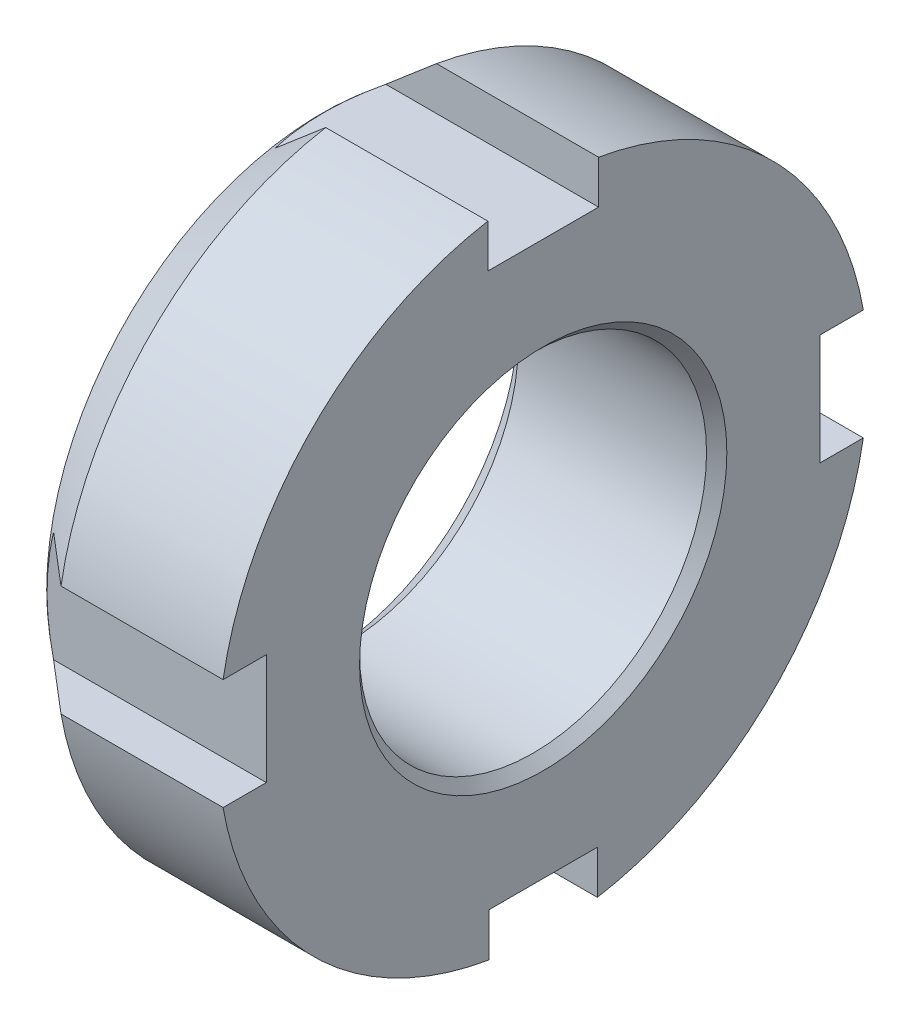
ISO-10303-21;
HEADER;
FILE_DESCRIPTION(('STEP AP214'),'2;1');
FILE_NAME('part.step','',(''),(''),'','','');
FILE_SCHEMA(('AUTOMOTIVE_DESIGN { 1 0 10303 214 1 1 1 1 }'));
ENDSEC;
DATA;
#1=APPLICATION_CONTEXT('core data for automotive mechanical design processes');
#2=APPLICATION_PROTOCOL_DEFINITION('international standard','automotive_design',2000,#1);
#3=PRODUCT_CONTEXT('',#1,'mechanical');
#4=PRODUCT('Part','Part','',(#3));
#5=PRODUCT_RELATED_PRODUCT_CATEGORY('part','',(#4));
#6=PRODUCT_DEFINITION_FORMATION('','',#4);
#7=PRODUCT_DEFINITION_CONTEXT('part definition',#1,'design');
#8=PRODUCT_DEFINITION('design','',#6,#7);
#9=PRODUCT_DEFINITION_SHAPE('','',#8);
#10=(LENGTH_UNIT() NAMED_UNIT(*) SI_UNIT(.MILLI.,.METRE.));
#11=(NAMED_UNIT(*) PLANE_ANGLE_UNIT() SI_UNIT($,.RADIAN.));
#12=(NAMED_UNIT(*) SI_UNIT($,.STERADIAN.) SOLID_ANGLE_UNIT());
#13=UNCERTAINTY_MEASURE_WITH_UNIT(LENGTH_MEASURE(1.E-05),#10,'distance_accuracy_value','');
#14=(GEOMETRIC_REPRESENTATION_CONTEXT(3) GLOBAL_UNCERTAINTY_ASSIGNED_CONTEXT((#13)) GLOBAL_UNIT_ASSIGNED_CONTEXT((#10,
#11,#12)) REPRESENTATION_CONTEXT('',''));
#15=CARTESIAN_POINT('',(0.,0.,0.));
#16=DIRECTION('',(0.,0.,1.));
#17=DIRECTION('',(1.,0.,0.));
#18=AXIS2_PLACEMENT_3D('',#15,#16,#17);
#19=CARTESIAN_POINT('',(0.,0.,0.));
#20=DIRECTION('',(-1.,0.,0.));
#21=DIRECTION('',(0.,0.,1.));
#22=AXIS2_PLACEMENT_3D('',#19,#20,#21);
#23=CYLINDRICAL_SURFACE('',#22,11.176);
#24=CARTESIAN_POINT('',(2.04326153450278,0.,0.));
#25=DIRECTION('',(-1.,0.,0.));
#26=DIRECTION('',(0.,0.,1.));
#27=AXIS2_PLACEMENT_3D('',#24,#25,#26);
#28=CIRCLE('',#27,11.176);
#29=CARTESIAN_POINT('',(2.04326153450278,-11.0196846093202,1.86266666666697));
#30=VERTEX_POINT('',#29);
#31=CARTESIAN_POINT('',(2.04326153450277,-1.905,11.0124452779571));
#32=VERTEX_POINT('',#31);
#33=EDGE_CURVE('E219',#30,#32,#28,.T.);
#34=ORIENTED_EDGE('',*,*,#33,.F.);
#35=DIRECTION('',(1.,0.,0.));
#36=VECTOR('',#35,1.);
#37=CARTESIAN_POINT('',(0.,-11.0196846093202,1.86266666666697));
#38=LINE('',#37,#36);
#39=CARTESIAN_POINT('',(7.62000000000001,-11.0196846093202,1.86266666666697));
#40=VERTEX_POINT('',#39);
#41=EDGE_CURVE('E267',#30,#40,#38,.T.);
#42=ORIENTED_EDGE('',*,*,#41,.T.);
#43=CARTESIAN_POINT('',(7.62000000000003,0.,0.));
#44=DIRECTION('',(-1.,0.,0.));
#45=DIRECTION('',(0.,0.,1.));
#46=AXIS2_PLACEMENT_3D('',#43,#44,#45);
#47=CIRCLE('',#46,11.176);
#48=CARTESIAN_POINT('',(7.62000000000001,-1.905,11.0124452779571));
#49=VERTEX_POINT('',#48);
#50=EDGE_CURVE('E183',#40,#49,#47,.T.);
#51=ORIENTED_EDGE('',*,*,#50,.T.);
#52=DIRECTION('',(1.,0.,0.));
#53=VECTOR('',#52,1.);
#54=CARTESIAN_POINT('',(0.,-1.905,11.0124452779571));
#55=LINE('',#54,#53);
#56=EDGE_CURVE('E237',#32,#49,#55,.T.);
#57=ORIENTED_EDGE('',*,*,#56,.F.);
#58=EDGE_LOOP('',(#34,#42,#51,#57));
#59=FACE_BOUND('',#58,.T.);
#60=ADVANCED_FACE('F39',(#59),#23,.T.);
#61=CARTESIAN_POINT('',(2.04326153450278,11.0124452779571,-1.905));
#62=VERTEX_POINT('',#61);
#63=CARTESIAN_POINT('',(2.04326153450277,1.905,-11.0124452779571));
#64=VERTEX_POINT('',#63);
#65=EDGE_CURVE('E229',#62,#64,#28,.T.);
#66=ORIENTED_EDGE('',*,*,#65,.F.);
#67=DIRECTION('',(1.,0.,0.));
#68=VECTOR('',#67,1.);
#69=CARTESIAN_POINT('',(0.,11.0124452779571,-1.905));
#70=LINE('',#69,#68);
#71=CARTESIAN_POINT('',(7.62000000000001,11.0124452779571,-1.905));
#72=VERTEX_POINT('',#71);
#73=EDGE_CURVE('E254',#62,#72,#70,.T.);
#74=ORIENTED_EDGE('',*,*,#73,.T.);
#75=CARTESIAN_POINT('',(7.62000000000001,1.905,-11.0124452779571));
#76=VERTEX_POINT('',#75);
#77=EDGE_CURVE('E189',#72,#76,#47,.T.);
#78=ORIENTED_EDGE('',*,*,#77,.T.);
#79=DIRECTION('',(1.,0.,0.));
#80=VECTOR('',#79,1.);
#81=CARTESIAN_POINT('',(0.,1.905,-11.0124452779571));
#82=LINE('',#81,#80);
#83=EDGE_CURVE('E222',#64,#76,#82,.T.);
#84=ORIENTED_EDGE('',*,*,#83,.F.);
#85=EDGE_LOOP('',(#66,#74,#78,#84));
#86=FACE_BOUND('',#85,.T.);
#87=ADVANCED_FACE('F301',(#86),#23,.T.);
#88=CARTESIAN_POINT('',(7.62000000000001,-1.90500000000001,-11.0124452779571));
#89=VERTEX_POINT('',#88);
#90=CARTESIAN_POINT('',(7.62000000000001,-11.0196846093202,-1.86266666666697));
#91=VERTEX_POINT('',#90);
#92=EDGE_CURVE('E174',#89,#91,#47,.T.);
#93=ORIENTED_EDGE('',*,*,#92,.T.);
#94=DIRECTION('',(1.,0.,0.));
#95=VECTOR('',#94,1.);
#96=CARTESIAN_POINT('',(0.,-11.0196846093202,-1.86266666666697));
#97=LINE('',#96,#95);
#98=CARTESIAN_POINT('',(2.04326153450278,-11.0196846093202,-1.86266666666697));
#99=VERTEX_POINT('',#98);
#100=EDGE_CURVE('E155',#99,#91,#97,.T.);
#101=ORIENTED_EDGE('',*,*,#100,.F.);
#102=CARTESIAN_POINT('',(2.04326153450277,-1.90500000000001,-11.0124452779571));
#103=VERTEX_POINT('',#102);
#104=EDGE_CURVE('E217',#103,#99,#28,.T.);
#105=ORIENTED_EDGE('',*,*,#104,.F.);
#106=DIRECTION('',(1.,0.,0.));
#107=VECTOR('',#106,1.);
#108=CARTESIAN_POINT('',(0.,-1.90500000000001,-11.0124452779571));
#109=LINE('',#108,#107);
#110=EDGE_CURVE('E181',#103,#89,#109,.T.);
#111=ORIENTED_EDGE('',*,*,#110,.T.);
#112=EDGE_LOOP('',(#93,#101,#105,#111));
#113=FACE_BOUND('',#112,.T.);
#114=ADVANCED_FACE('F180',(#113),#23,.T.);
#115=CARTESIAN_POINT('',(7.62000000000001,1.905,11.0124452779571));
#116=VERTEX_POINT('',#115);
#117=CARTESIAN_POINT('',(7.62000000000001,11.0124452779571,1.905));
#118=VERTEX_POINT('',#117);
#119=EDGE_CURVE('E185',#116,#118,#47,.T.);
#120=ORIENTED_EDGE('',*,*,#119,.T.);
#121=DIRECTION('',(1.,0.,0.));
#122=VECTOR('',#121,1.);
#123=CARTESIAN_POINT('',(0.,11.0124452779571,1.905));
#124=LINE('',#123,#122);
#125=CARTESIAN_POINT('',(2.04326153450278,11.0124452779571,1.905));
#126=VERTEX_POINT('',#125);
#127=EDGE_CURVE('E255',#126,#118,#124,.T.);
#128=ORIENTED_EDGE('',*,*,#127,.F.);
#129=CARTESIAN_POINT('',(2.04326153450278,1.905,11.0124452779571));
#130=VERTEX_POINT('',#129);
#131=EDGE_CURVE('E220',#130,#126,#28,.T.);
#132=ORIENTED_EDGE('',*,*,#131,.F.);
#133=DIRECTION('',(1.,0.,0.));
#134=VECTOR('',#133,1.);
#135=CARTESIAN_POINT('',(0.,1.905,11.0124452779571));
#136=LINE('',#135,#134);
#137=EDGE_CURVE('E243',#130,#116,#136,.T.);
#138=ORIENTED_EDGE('',*,*,#137,.T.);
#139=EDGE_LOOP('',(#120,#128,#132,#138));
#140=FACE_BOUND('',#139,.T.);
#141=ADVANCED_FACE('F41',(#140),#23,.T.);
#142=CARTESIAN_POINT('',(7.62000000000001,11.176,0.));
#143=DIRECTION('',(-1.,0.,0.));
#144=DIRECTION('',(0.,0.,1.));
#145=AXIS2_PLACEMENT_3D('',#142,#143,#144);
#146=PLANE('',#145);
#147=ORIENTED_EDGE('',*,*,#50,.F.);
#148=DIRECTION('',(0.,-1.,0.));
#149=VECTOR('',#148,1.);
#150=CARTESIAN_POINT('',(7.62000000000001,-9.525,1.86266666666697));
#151=LINE('',#150,#149);
#152=CARTESIAN_POINT('',(7.62000000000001,-9.525,1.86266666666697));
#153=VERTEX_POINT('',#152);
#154=EDGE_CURVE('E166',#153,#40,#151,.T.);
#155=ORIENTED_EDGE('',*,*,#154,.F.);
#156=DIRECTION('',(0.,0.,1.));
#157=VECTOR('',#156,1.);
#158=CARTESIAN_POINT('',(7.62000000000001,-9.525,1.86266666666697));
#159=LINE('',#158,#157);
#160=CARTESIAN_POINT('',(7.62000000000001,-9.525,-1.86266666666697));
#161=VERTEX_POINT('',#160);
#162=EDGE_CURVE('E177',#161,#153,#159,.T.);
#163=ORIENTED_EDGE('',*,*,#162,.F.);
#164=DIRECTION('',(0.,1.,0.));
#165=VECTOR('',#164,1.);
#166=CARTESIAN_POINT('',(7.62000000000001,-9.525,-1.86266666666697));
#167=LINE('',#166,#165);
#168=EDGE_CURVE('E158',#91,#161,#167,.T.);
#169=ORIENTED_EDGE('',*,*,#168,.F.);
#170=ORIENTED_EDGE('',*,*,#92,.F.);
#171=DIRECTION('',(0.,0.,-1.));
#172=VECTOR('',#171,1.);
#173=CARTESIAN_POINT('',(7.62000000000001,-1.905,-9.525));
#174=LINE('',#173,#172);
#175=CARTESIAN_POINT('',(7.62000000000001,-1.905,-9.525));
#176=VERTEX_POINT('',#175);
#177=EDGE_CURVE('E235',#176,#89,#174,.T.);
#178=ORIENTED_EDGE('',*,*,#177,.F.);
#179=DIRECTION('',(0.,-1.,0.));
#180=VECTOR('',#179,1.);
#181=CARTESIAN_POINT('',(7.62000000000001,1.905,-9.525));
#182=LINE('',#181,#180);
#183=CARTESIAN_POINT('',(7.62000000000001,1.905,-9.525));
#184=VERTEX_POINT('',#183);
#185=EDGE_CURVE('E223',#184,#176,#182,.T.);
#186=ORIENTED_EDGE('',*,*,#185,.F.);
#187=DIRECTION('',(0.,0.,1.));
#188=VECTOR('',#187,1.);
#189=CARTESIAN_POINT('',(7.62000000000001,1.905,-9.525));
#190=LINE('',#189,#188);
#191=EDGE_CURVE('E232',#76,#184,#190,.T.);
#192=ORIENTED_EDGE('',*,*,#191,.F.);
#193=ORIENTED_EDGE('',*,*,#77,.F.);
#194=DIRECTION('',(0.,1.,0.));
#195=VECTOR('',#194,1.);
#196=CARTESIAN_POINT('',(7.62000000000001,11.0124452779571,-1.905));
#197=LINE('',#196,#195);
#198=CARTESIAN_POINT('',(7.62000000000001,9.525,-1.905));
#199=VERTEX_POINT('',#198);
#200=EDGE_CURVE('E257',#199,#72,#197,.T.);
#201=ORIENTED_EDGE('',*,*,#200,.F.);
#202=DIRECTION('',(0.,0.,-1.));
#203=VECTOR('',#202,1.);
#204=CARTESIAN_POINT('',(7.62000000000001,9.525,1.905));
#205=LINE('',#204,#203);
#206=CARTESIAN_POINT('',(7.62000000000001,9.525,1.905));
#207=VERTEX_POINT('',#206);
#208=EDGE_CURVE('E263',#207,#199,#205,.T.);
#209=ORIENTED_EDGE('',*,*,#208,.F.);
#210=DIRECTION('',(0.,-1.,0.));
#211=VECTOR('',#210,1.);
#212=CARTESIAN_POINT('',(7.62000000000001,11.0124452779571,1.905));
#213=LINE('',#212,#211);
#214=EDGE_CURVE('E266',#118,#207,#213,.T.);
#215=ORIENTED_EDGE('',*,*,#214,.F.);
#216=ORIENTED_EDGE('',*,*,#119,.F.);
#217=DIRECTION('',(0.,0.,1.));
#218=VECTOR('',#217,1.);
#219=CARTESIAN_POINT('',(7.62000000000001,1.905,11.0124452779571));
#220=LINE('',#219,#218);
#221=CARTESIAN_POINT('',(7.62000000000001,1.905,9.525));
#222=VERTEX_POINT('',#221);
#223=EDGE_CURVE('E241',#222,#116,#220,.T.);
#224=ORIENTED_EDGE('',*,*,#223,.F.);
#225=DIRECTION('',(0.,1.,0.));
#226=VECTOR('',#225,1.);
#227=CARTESIAN_POINT('',(7.62000000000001,1.905,9.525));
#228=LINE('',#227,#226);
#229=CARTESIAN_POINT('',(7.62000000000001,-1.905,9.525));
#230=VERTEX_POINT('',#229);
#231=EDGE_CURVE('E248',#230,#222,#228,.T.);
#232=ORIENTED_EDGE('',*,*,#231,.F.);
#233=DIRECTION('',(0.,0.,-1.));
#234=VECTOR('',#233,1.);
#235=CARTESIAN_POINT('',(7.62000000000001,-1.905,11.0124452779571));
#236=LINE('',#235,#234);
#237=EDGE_CURVE('E251',#49,#230,#236,.T.);
#238=ORIENTED_EDGE('',*,*,#237,.F.);
#239=EDGE_LOOP('',(#147,#155,#163,#169,#170,#178,#186,#192,#193,#201,#209,#215,#216,#224,#232,#238));
#240=FACE_BOUND('',#239,.T.);
#241=CARTESIAN_POINT('',(7.62,0.,0.));
#242=DIRECTION('',(-1.,0.,0.));
#243=DIRECTION('',(0.,0.,1.));
#244=AXIS2_PLACEMENT_3D('',#241,#242,#243);
#245=CIRCLE('',#244,6.31824999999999);
#246=CARTESIAN_POINT('',(7.62,0.,6.31824999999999));
#247=VERTEX_POINT('',#246);
#248=EDGE_CURVE('E196',#247,#247,#245,.T.);
#249=ORIENTED_EDGE('',*,*,#248,.T.);
#250=EDGE_LOOP('',(#249));
#251=FACE_BOUND('',#250,.T.);
#252=ADVANCED_FACE('F171',(#240,#251),#146,.F.);
#253=CARTESIAN_POINT('',(7.27075,0.,0.));
#254=DIRECTION('',(1.,0.,0.));
#255=DIRECTION('',(0.,0.,-1.));
#256=AXIS2_PLACEMENT_3D('',#253,#254,#255);
#257=CONICAL_SURFACE('',#256,5.969,0.785398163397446);
#258=ORIENTED_EDGE('',*,*,#248,.F.);
#259=EDGE_LOOP('',(#258));
#260=FACE_BOUND('',#259,.T.);
#261=CARTESIAN_POINT('',(7.27075,0.,0.));
#262=DIRECTION('',(-1.,0.,0.));
#263=DIRECTION('',(0.,0.,1.));
#264=AXIS2_PLACEMENT_3D('',#261,#262,#263);
#265=CIRCLE('',#264,5.969);
#266=CARTESIAN_POINT('',(7.27075,0.,5.969));
#267=VERTEX_POINT('',#266);
#268=EDGE_CURVE('E203',#267,#267,#265,.T.);
#269=ORIENTED_EDGE('',*,*,#268,.T.);
#270=EDGE_LOOP('',(#269));
#271=FACE_BOUND('',#270,.T.);
#272=ADVANCED_FACE('F313',(#260,#271),#257,.F.);
#273=CARTESIAN_POINT('',(0.,0.,0.));
#274=DIRECTION('',(-1.,0.,0.));
#275=DIRECTION('',(0.,0.,1.));
#276=AXIS2_PLACEMENT_3D('',#273,#274,#275);
#277=CYLINDRICAL_SURFACE('',#276,5.969);
#278=ORIENTED_EDGE('',*,*,#268,.F.);
#279=EDGE_LOOP('',(#278));
#280=FACE_BOUND('',#279,.T.);
#281=CARTESIAN_POINT('',(0.793750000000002,0.,0.));
#282=DIRECTION('',(-1.,0.,0.));
#283=DIRECTION('',(0.,0.,1.));
#284=AXIS2_PLACEMENT_3D('',#281,#282,#283);
#285=CIRCLE('',#284,5.969);
#286=CARTESIAN_POINT('',(0.793750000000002,0.,5.969));
#287=VERTEX_POINT('',#286);
#288=EDGE_CURVE('E206',#287,#287,#285,.T.);
#289=ORIENTED_EDGE('',*,*,#288,.T.);
#290=EDGE_LOOP('',(#289));
#291=FACE_BOUND('',#290,.T.);
#292=ADVANCED_FACE('F317',(#280,#291),#277,.F.);
#293=CARTESIAN_POINT('',(0.,0.,0.));
#294=DIRECTION('',(-1.,0.,0.));
#295=DIRECTION('',(0.,0.,1.));
#296=AXIS2_PLACEMENT_3D('',#293,#294,#295);
#297=CONICAL_SURFACE('',#296,6.76275000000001,0.785398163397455);
#298=ORIENTED_EDGE('',*,*,#288,.F.);
#299=EDGE_LOOP('',(#298));
#300=FACE_BOUND('',#299,.T.);
#301=CARTESIAN_POINT('',(0.,0.,0.));
#302=DIRECTION('',(-1.,0.,0.));
#303=DIRECTION('',(0.,0.,1.));
#304=AXIS2_PLACEMENT_3D('',#301,#302,#303);
#305=CIRCLE('',#304,6.76275000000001);
#306=CARTESIAN_POINT('',(0.,0.,6.76275000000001));
#307=VERTEX_POINT('',#306);
#308=EDGE_CURVE('E211',#307,#307,#305,.T.);
#309=ORIENTED_EDGE('',*,*,#308,.T.);
#310=EDGE_LOOP('',(#309));
#311=FACE_BOUND('',#310,.T.);
#312=ADVANCED_FACE('F323',(#300,#311),#297,.F.);
#313=CARTESIAN_POINT('',(0.,9.46150000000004,0.));
#314=DIRECTION('',(1.,0.,0.));
#315=DIRECTION('',(0.,0.,-1.));
#316=AXIS2_PLACEMENT_3D('',#313,#314,#315);
#317=PLANE('',#316);
#318=ORIENTED_EDGE('',*,*,#308,.F.);
#319=EDGE_LOOP('',(#318));
#320=FACE_BOUND('',#319,.T.);
#321=CARTESIAN_POINT('',(0.,0.,0.));
#322=DIRECTION('',(-1.,0.,0.));
#323=DIRECTION('',(0.,0.,1.));
#324=AXIS2_PLACEMENT_3D('',#321,#322,#323);
#325=CIRCLE('',#324,9.46150000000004);
#326=CARTESIAN_POINT('',(0.,0.,9.46150000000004));
#327=VERTEX_POINT('',#326);
#328=EDGE_CURVE('E214',#327,#327,#325,.T.);
#329=ORIENTED_EDGE('',*,*,#328,.T.);
#330=EDGE_LOOP('',(#329));
#331=FACE_BOUND('',#330,.T.);
#332=ADVANCED_FACE('F327',(#320,#331),#317,.F.);
#333=CARTESIAN_POINT('',(2.04326153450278,0.,0.));
#334=DIRECTION('',(1.,0.,0.));
#335=DIRECTION('',(0.,0.,-1.));
#336=AXIS2_PLACEMENT_3D('',#333,#334,#335);
#337=CONICAL_SURFACE('',#336,11.176,0.698131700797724);
#338=CARTESIAN_POINT('',(1.46374416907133,-9.525,-4.85228218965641));
#339=CARTESIAN_POINT('',(1.3914965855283,-9.525,-4.71871655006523));
#340=CARTESIAN_POINT('',(1.32107297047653,-9.525,-4.58416724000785));
#341=CARTESIAN_POINT('',(1.18430078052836,-9.525,-4.31296611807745));
#342=CARTESIAN_POINT('',(1.11795340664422,-9.525,-4.1763137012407));
#343=CARTESIAN_POINT('',(0.925339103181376,-9.525,-3.76227951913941));
#344=CARTESIAN_POINT('',(0.805945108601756,-9.525,-3.48163228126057));
#345=CARTESIAN_POINT('',(0.590437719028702,-9.525,-2.91325977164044));
#346=CARTESIAN_POINT('',(0.494196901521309,-9.525,-2.62558330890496));
#347=CARTESIAN_POINT('',(0.32890550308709,-9.525,-2.04275175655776));
#348=CARTESIAN_POINT('',(0.259820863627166,-9.525,-1.74760653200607));
#349=CARTESIAN_POINT('',(0.162286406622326,-9.525,-1.20369600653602));
#350=CARTESIAN_POINT('',(0.12884871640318,-9.525,-0.955827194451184));
#351=CARTESIAN_POINT('',(0.0849427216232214,-9.525,-0.457994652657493));
#352=CARTESIAN_POINT('',(0.0744770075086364,-9.525,-0.208030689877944));
#353=CARTESIAN_POINT('',(0.077095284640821,-9.525,0.291817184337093));
#354=CARTESIAN_POINT('',(0.0901835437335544,-9.525,0.541701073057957));
#355=CARTESIAN_POINT('',(0.139205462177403,-9.525,1.03914820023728));
#356=CARTESIAN_POINT('',(0.175136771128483,-9.525,1.28671167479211));
#357=CARTESIAN_POINT('',(0.277681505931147,-9.525,1.82845110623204));
#358=CARTESIAN_POINT('',(0.349092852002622,-9.525,2.12171600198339));
#359=CARTESIAN_POINT('',(0.518400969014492,-9.525,2.70072233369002));
#360=CARTESIAN_POINT('',(0.616329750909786,-9.525,2.98645421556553));
#361=CARTESIAN_POINT('',(0.834537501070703,-9.525,3.55067874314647));
#362=CARTESIAN_POINT('',(0.95491724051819,-9.525,3.82913202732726));
#363=CARTESIAN_POINT('',(1.14863905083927,-9.525,4.23998566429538));
#364=CARTESIAN_POINT('',(1.21529645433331,-9.525,4.3756030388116));
#365=CARTESIAN_POINT('',(1.35257966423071,-9.525,4.64476845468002));
#366=CARTESIAN_POINT('',(1.42320434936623,-9.525,4.77831706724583));
#367=CARTESIAN_POINT('',(1.49560507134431,-9.52500000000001,4.91089865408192));
#368=B_SPLINE_CURVE_WITH_KNOTS('',3,(#338,#339,#340,#341,#342,#343,#344,#345,#346,#347,#348,
#349,#350,#351,#352,#353,#354,#355,#356,#357,#358,#359,#360,#361,#362,#363,#364,#365,#366,#367),
.UNSPECIFIED.,.F.,.F.,(4,2,2,2,2,2,2,2,2,2,2,2,2,2,4),(0.,0.455533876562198,0.911201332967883,
1.82530788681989,2.73426230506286,3.64207307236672,4.39143015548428,5.140871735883,
5.89044912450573,6.63994939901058,7.54394990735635,8.44904659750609,9.35830810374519,
9.81159614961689,10.2647567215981),.UNSPECIFIED.);
#369=CARTESIAN_POINT('',(0.290690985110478,-9.525,-1.86266666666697));
#370=VERTEX_POINT('',#369);
#371=CARTESIAN_POINT('',(0.29069098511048,-9.525,1.86266666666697));
#372=VERTEX_POINT('',#371);
#373=EDGE_CURVE('E52',#370,#372,#368,.T.);
#374=ORIENTED_EDGE('',*,*,#373,.T.);
#375=CARTESIAN_POINT('',(-3.20321192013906,-6.51254909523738,1.86266666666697));
#376=CARTESIAN_POINT('',(-2.89999402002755,-6.7771381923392,1.86266666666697));
#377=CARTESIAN_POINT('',(-2.59621719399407,-7.04108457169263,1.86266666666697));
#378=CARTESIAN_POINT('',(-1.98779375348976,-7.56797069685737,1.86266666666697));
#379=CARTESIAN_POINT('',(-1.68314714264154,-7.83091044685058,1.86266666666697));
#380=CARTESIAN_POINT('',(-1.07323288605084,-8.35606154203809,1.86266666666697));
#381=CARTESIAN_POINT('',(-0.767965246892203,-8.61827289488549,1.86266666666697));
#382=CARTESIAN_POINT('',(-0.156948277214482,-9.14213439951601,1.86266666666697));
#383=CARTESIAN_POINT('',(0.148801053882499,-9.40378455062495,1.86266666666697));
#384=CARTESIAN_POINT('',(1.06659614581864,-10.1880823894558,1.86266666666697));
#385=CARTESIAN_POINT('',(1.67919507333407,-10.710082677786,1.86266666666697));
#386=CARTESIAN_POINT('',(2.59880106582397,-11.4922570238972,1.86266666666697));
#387=CARTESIAN_POINT('',(2.90545599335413,-11.7528455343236,1.86266666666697));
#388=CARTESIAN_POINT('',(3.51896269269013,-12.2737902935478,1.86266666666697));
#389=CARTESIAN_POINT('',(3.82581446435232,-12.5341465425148,1.86266666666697));
#390=CARTESIAN_POINT('',(4.13274592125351,-12.7944088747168,1.86266666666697));
#391=B_SPLINE_CURVE_WITH_KNOTS('',3,(#375,#376,#377,#378,#379,#380,#381,#382,#383,#384,#385,
#386,#387,#388,#389,#390),.UNSPECIFIED.,.F.,.F.,(4,2,2,2,2,2,2,4),(0.,1.20728174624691,
2.41455847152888,3.62182246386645,4.82908790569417,7.24359478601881,8.45086130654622,
9.65812694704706),.UNSPECIFIED.);
#392=EDGE_CURVE('E12',#372,#30,#391,.T.);
#393=ORIENTED_EDGE('',*,*,#392,.T.);
#394=ORIENTED_EDGE('',*,*,#33,.T.);
#395=CARTESIAN_POINT('',(4.13145760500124,-1.905,12.7870812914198));
#396=CARTESIAN_POINT('',(3.82488668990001,-1.905,12.526997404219));
#397=CARTESIAN_POINT('',(3.51839907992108,-1.905,12.266815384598));
#398=CARTESIAN_POINT('',(2.90562961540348,-1.905,11.7462086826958));
#399=CARTESIAN_POINT('',(2.59934776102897,-1.905,11.4857840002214));
#400=CARTESIAN_POINT('',(1.68087753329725,-1.905,10.7040831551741));
#401=CARTESIAN_POINT('',(1.06905723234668,-1.905,10.1823740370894));
#402=CARTESIAN_POINT('',(0.152479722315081,-1.905,9.39845542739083));
#403=CARTESIAN_POINT('',(-0.152855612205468,-1.905,9.13692197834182));
#404=CARTESIAN_POINT('',(-0.763022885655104,-1.905,8.61326920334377));
#405=CARTESIAN_POINT('',(-1.06785482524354,-1.905,8.35114987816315));
#406=CARTESIAN_POINT('',(-1.67686991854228,-1.905,7.82615083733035));
#407=CARTESIAN_POINT('',(-1.98105306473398,-1.905,7.56327111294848));
#408=CARTESIAN_POINT('',(-2.58851061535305,-1.905,7.0364613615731));
#409=CARTESIAN_POINT('',(-2.89178501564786,-1.905,6.77253132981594));
#410=CARTESIAN_POINT('',(-3.1944754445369,-1.905,6.50793087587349));
#411=B_SPLINE_CURVE_WITH_KNOTS('',3,(#395,#396,#397,#398,#399,#400,#401,#402,#403,#404,#405,
#406,#407,#408,#409,#410),.UNSPECIFIED.,.F.,.F.,(4,2,2,2,2,2,2,4),(0.,1.20609447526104,
2.4121899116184,4.82435221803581,6.03044646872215,7.23653913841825,8.44264570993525,
9.64875775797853),.UNSPECIFIED.);
#412=CARTESIAN_POINT('',(0.300479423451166,-1.905,9.525));
#413=VERTEX_POINT('',#412);
#414=EDGE_CURVE('E371',#32,#413,#411,.T.);
#415=ORIENTED_EDGE('',*,*,#414,.T.);
#416=CARTESIAN_POINT('',(1.48880459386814,-4.89843402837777,9.525));
#417=CARTESIAN_POINT('',(1.41575425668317,-4.76439345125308,9.525));
#418=CARTESIAN_POINT('',(1.3445236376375,-4.62936406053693,9.525));
#419=CARTESIAN_POINT('',(1.20613078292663,-4.35718893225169,9.525));
#420=CARTESIAN_POINT('',(1.13896974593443,-4.22004258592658,9.525));
#421=CARTESIAN_POINT('',(0.943897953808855,-3.80448716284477,9.525));
#422=CARTESIAN_POINT('',(0.82285424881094,-3.52278632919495,9.525));
#423=CARTESIAN_POINT('',(0.604030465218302,-2.95208136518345,9.525));
#424=CARTESIAN_POINT('',(0.506132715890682,-2.66312281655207,9.525));
#425=CARTESIAN_POINT('',(0.337647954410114,-2.07758300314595,9.525));
#426=CARTESIAN_POINT('',(0.267026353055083,-1.78101190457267,9.525));
#427=CARTESIAN_POINT('',(0.167123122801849,-1.23561198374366,9.525));
#428=CARTESIAN_POINT('',(0.132708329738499,-0.987725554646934,9.525));
#429=CARTESIAN_POINT('',(0.086825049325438,-0.489768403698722,9.525));
#430=CARTESIAN_POINT('',(0.0753590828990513,-0.239697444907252,9.525));
#431=CARTESIAN_POINT('',(0.0760070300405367,0.260400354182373,9.525));
#432=CARTESIAN_POINT('',(0.0881197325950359,0.510427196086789,9.525));
#433=CARTESIAN_POINT('',(0.135260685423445,1.00824223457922,9.525));
#434=CARTESIAN_POINT('',(0.170286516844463,1.25603066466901,9.525));
#435=CARTESIAN_POINT('',(0.270635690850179,1.79664344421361,9.525));
#436=CARTESIAN_POINT('',(0.340605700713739,2.0886024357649,9.525));
#437=CARTESIAN_POINT('',(0.506928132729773,2.66512752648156,9.525));
#438=CARTESIAN_POINT('',(0.603312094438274,2.94968433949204,9.525));
#439=CARTESIAN_POINT('',(0.818436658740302,3.51177910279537,9.525));
#440=CARTESIAN_POINT('',(0.937287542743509,3.78927442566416,9.525));
#441=CARTESIAN_POINT('',(1.12873410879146,4.19874380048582,9.525));
#442=CARTESIAN_POINT('',(1.19463845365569,4.33391143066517,9.525));
#443=CARTESIAN_POINT('',(1.33042232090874,4.60218968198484,9.525));
#444=CARTESIAN_POINT('',(1.40030071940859,4.73530087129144,9.525));
#445=CARTESIAN_POINT('',(1.47195932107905,4.86744960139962,9.525));
#446=B_SPLINE_CURVE_WITH_KNOTS('',3,(#416,#417,#418,#419,#420,#421,#422,#423,#424,#425,#426,
#427,#428,#429,#430,#431,#432,#433,#434,#435,#436,#437,#438,#439,#440,#441,#442,#443,#444,#445),
.UNSPECIFIED.,.F.,.F.,(4,2,2,2,2,2,2,2,2,2,2,2,2,2,4),(0.,0.457935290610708,0.916004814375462,
1.83496542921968,2.74914858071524,3.66216860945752,4.41197980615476,5.16187336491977,
5.91172840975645,6.66150430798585,7.56069294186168,8.46095996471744,9.365766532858,
9.81684912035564,10.2678047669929),.UNSPECIFIED.);
#447=CARTESIAN_POINT('',(0.300479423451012,1.90500000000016,9.525));
#448=VERTEX_POINT('',#447);
#449=EDGE_CURVE('E357',#413,#448,#446,.T.);
#450=ORIENTED_EDGE('',*,*,#449,.T.);
#451=CARTESIAN_POINT('',(-3.1944754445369,1.905,6.50793087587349));
#452=CARTESIAN_POINT('',(-2.89178501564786,1.905,6.77253132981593));
#453=CARTESIAN_POINT('',(-2.58851061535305,1.905,7.03646136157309));
#454=CARTESIAN_POINT('',(-1.98105306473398,1.905,7.56327111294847));
#455=CARTESIAN_POINT('',(-1.67686991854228,1.905,7.82615083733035));
#456=CARTESIAN_POINT('',(-1.06785482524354,1.905,8.35114987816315));
#457=CARTESIAN_POINT('',(-0.763022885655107,1.905,8.61326920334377));
#458=CARTESIAN_POINT('',(-0.15285561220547,1.905,9.13692197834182));
#459=CARTESIAN_POINT('',(0.152479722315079,1.905,9.39845542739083));
#460=CARTESIAN_POINT('',(1.06905723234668,1.905,10.1823740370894));
#461=CARTESIAN_POINT('',(1.68087753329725,1.905,10.7040831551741));
#462=CARTESIAN_POINT('',(2.59934776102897,1.905,11.4857840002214));
#463=CARTESIAN_POINT('',(2.90562961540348,1.905,11.7462086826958));
#464=CARTESIAN_POINT('',(3.51839907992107,1.905,12.266815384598));
#465=CARTESIAN_POINT('',(3.82488668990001,1.905,12.526997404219));
#466=CARTESIAN_POINT('',(4.13145760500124,1.905,12.7870812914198));
#467=B_SPLINE_CURVE_WITH_KNOTS('',3,(#451,#452,#453,#454,#455,#456,#457,#458,#459,#460,#461,
#462,#463,#464,#465,#466),.UNSPECIFIED.,.F.,.F.,(4,2,2,2,2,2,2,4),(0.,1.20611204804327,
2.41221861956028,3.61831128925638,4.82440553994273,7.23656784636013,8.4426632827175,
9.64875775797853),.UNSPECIFIED.);
#468=EDGE_CURVE('E364',#448,#130,#467,.T.);
#469=ORIENTED_EDGE('',*,*,#468,.T.);
#470=ORIENTED_EDGE('',*,*,#131,.T.);
#471=CARTESIAN_POINT('',(4.13145760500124,12.7870812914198,1.905));
#472=CARTESIAN_POINT('',(3.82488668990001,12.526997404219,1.905));
#473=CARTESIAN_POINT('',(3.51839907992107,12.266815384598,1.905));
#474=CARTESIAN_POINT('',(2.90562961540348,11.7462086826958,1.905));
#475=CARTESIAN_POINT('',(2.59934776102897,11.4857840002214,1.905));
#476=CARTESIAN_POINT('',(1.68087753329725,10.7040831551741,1.905));
#477=CARTESIAN_POINT('',(1.06905723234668,10.1823740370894,1.905));
#478=CARTESIAN_POINT('',(0.15247972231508,9.39845542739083,1.905));
#479=CARTESIAN_POINT('',(-0.152855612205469,9.13692197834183,1.905));
#480=CARTESIAN_POINT('',(-0.763022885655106,8.61326920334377,1.905));
#481=CARTESIAN_POINT('',(-1.06785482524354,8.35114987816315,1.905));
#482=CARTESIAN_POINT('',(-1.67686991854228,7.82615083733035,1.905));
#483=CARTESIAN_POINT('',(-1.98105306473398,7.56327111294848,1.905));
#484=CARTESIAN_POINT('',(-2.58851061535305,7.03646136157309,1.905));
#485=CARTESIAN_POINT('',(-2.89178501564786,6.77253132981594,1.905));
#486=CARTESIAN_POINT('',(-3.1944754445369,6.50793087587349,1.905));
#487=B_SPLINE_CURVE_WITH_KNOTS('',3,(#471,#472,#473,#474,#475,#476,#477,#478,#479,#480,#481,
#482,#483,#484,#485,#486),.UNSPECIFIED.,.F.,.F.,(4,2,2,2,2,2,2,4),(0.,1.20609447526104,
2.4121899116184,4.82435221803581,6.03044646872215,7.23653913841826,8.44264570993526,
9.64875775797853),.UNSPECIFIED.);
#488=CARTESIAN_POINT('',(0.300479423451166,9.525,1.905));
#489=VERTEX_POINT('',#488);
#490=EDGE_CURVE('E378',#126,#489,#487,.T.);
#491=ORIENTED_EDGE('',*,*,#490,.T.);
#492=CARTESIAN_POINT('',(1.48880459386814,9.525,-4.89843402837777));
#493=CARTESIAN_POINT('',(1.41575425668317,9.525,-4.76439345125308));
#494=CARTESIAN_POINT('',(1.3445236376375,9.525,-4.62936406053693));
#495=CARTESIAN_POINT('',(1.20613078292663,9.525,-4.35718893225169));
#496=CARTESIAN_POINT('',(1.13896974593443,9.525,-4.22004258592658));
#497=CARTESIAN_POINT('',(0.943897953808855,9.525,-3.80448716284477));
#498=CARTESIAN_POINT('',(0.82285424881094,9.525,-3.52278632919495));
#499=CARTESIAN_POINT('',(0.604030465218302,9.525,-2.95208136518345));
#500=CARTESIAN_POINT('',(0.506132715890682,9.525,-2.66312281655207));
#501=CARTESIAN_POINT('',(0.337647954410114,9.525,-2.07758300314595));
#502=CARTESIAN_POINT('',(0.267026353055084,9.525,-1.78101190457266));
#503=CARTESIAN_POINT('',(0.167123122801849,9.525,-1.23561198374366));
#504=CARTESIAN_POINT('',(0.132708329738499,9.525,-0.987725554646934));
#505=CARTESIAN_POINT('',(0.0868250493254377,9.525,-0.489768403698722));
#506=CARTESIAN_POINT('',(0.0753590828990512,9.525,-0.239697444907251));
#507=CARTESIAN_POINT('',(0.0760070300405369,9.525,0.260400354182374));
#508=CARTESIAN_POINT('',(0.088119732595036,9.525,0.51042719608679));
#509=CARTESIAN_POINT('',(0.135260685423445,9.525,1.00824223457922));
#510=CARTESIAN_POINT('',(0.170286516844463,9.525,1.25603066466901));
#511=CARTESIAN_POINT('',(0.270635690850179,9.525,1.79664344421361));
#512=CARTESIAN_POINT('',(0.340605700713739,9.525,2.0886024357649));
#513=CARTESIAN_POINT('',(0.506928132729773,9.525,2.66512752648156));
#514=CARTESIAN_POINT('',(0.603312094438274,9.525,2.94968433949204));
#515=CARTESIAN_POINT('',(0.818436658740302,9.525,3.51177910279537));
#516=CARTESIAN_POINT('',(0.937287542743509,9.525,3.78927442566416));
#517=CARTESIAN_POINT('',(1.12873410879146,9.525,4.19874380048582));
#518=CARTESIAN_POINT('',(1.19463845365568,9.525,4.33391143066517));
#519=CARTESIAN_POINT('',(1.33042232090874,9.525,4.60218968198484));
#520=CARTESIAN_POINT('',(1.40030071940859,9.525,4.73530087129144));
#521=CARTESIAN_POINT('',(1.47195932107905,9.525,4.86744960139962));
#522=B_SPLINE_CURVE_WITH_KNOTS('',3,(#492,#493,#494,#495,#496,#497,#498,#499,#500,#501,#502,
#503,#504,#505,#506,#507,#508,#509,#510,#511,#512,#513,#514,#515,#516,#517,#518,#519,#520,#521),
.UNSPECIFIED.,.F.,.F.,(4,2,2,2,2,2,2,2,2,2,2,2,2,2,4),(0.,0.457935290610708,0.916004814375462,
1.83496542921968,2.74914858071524,3.66216860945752,4.41197980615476,5.16187336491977,
5.91172840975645,6.66150430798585,7.56069294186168,8.46095996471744,9.365766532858,
9.81684912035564,10.2678047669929),.UNSPECIFIED.);
#523=CARTESIAN_POINT('',(0.300479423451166,9.525,-1.905));
#524=VERTEX_POINT('',#523);
#525=EDGE_CURVE('E385',#489,#524,#522,.F.);
#526=ORIENTED_EDGE('',*,*,#525,.T.);
#527=CARTESIAN_POINT('',(-3.1944754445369,6.50793087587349,-1.905));
#528=CARTESIAN_POINT('',(-2.89178501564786,6.77253132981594,-1.905));
#529=CARTESIAN_POINT('',(-2.58851061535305,7.03646136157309,-1.905));
#530=CARTESIAN_POINT('',(-1.98105306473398,7.56327111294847,-1.905));
#531=CARTESIAN_POINT('',(-1.67686991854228,7.82615083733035,-1.905));
#532=CARTESIAN_POINT('',(-1.06785482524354,8.35114987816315,-1.905));
#533=CARTESIAN_POINT('',(-0.763022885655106,8.61326920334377,-1.905));
#534=CARTESIAN_POINT('',(-0.15285561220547,9.13692197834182,-1.905));
#535=CARTESIAN_POINT('',(0.152479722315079,9.39845542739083,-1.905));
#536=CARTESIAN_POINT('',(1.06905723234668,10.1823740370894,-1.905));
#537=CARTESIAN_POINT('',(1.68087753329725,10.7040831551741,-1.905));
#538=CARTESIAN_POINT('',(2.59934776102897,11.4857840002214,-1.905));
#539=CARTESIAN_POINT('',(2.90562961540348,11.7462086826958,-1.905));
#540=CARTESIAN_POINT('',(3.51839907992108,12.266815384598,-1.905));
#541=CARTESIAN_POINT('',(3.82488668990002,12.526997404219,-1.905));
#542=CARTESIAN_POINT('',(4.13145760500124,12.7870812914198,-1.905));
#543=B_SPLINE_CURVE_WITH_KNOTS('',3,(#527,#528,#529,#530,#531,#532,#533,#534,#535,#536,#537,
#538,#539,#540,#541,#542),.UNSPECIFIED.,.F.,.F.,(4,2,2,2,2,2,2,4),(0.,1.20611204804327,
2.41221861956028,3.61831128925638,4.82440553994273,7.23656784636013,8.4426632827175,
9.64875775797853),.UNSPECIFIED.);
#544=EDGE_CURVE('E296',#524,#62,#543,.T.);
#545=ORIENTED_EDGE('',*,*,#544,.T.);
#546=ORIENTED_EDGE('',*,*,#65,.T.);
#547=CARTESIAN_POINT('',(4.13145760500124,1.905,-12.7870812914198));
#548=CARTESIAN_POINT('',(3.82488668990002,1.905,-12.526997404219));
#549=CARTESIAN_POINT('',(3.51839907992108,1.905,-12.266815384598));
#550=CARTESIAN_POINT('',(2.90562961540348,1.905,-11.7462086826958));
#551=CARTESIAN_POINT('',(2.59934776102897,1.905,-11.4857840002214));
#552=CARTESIAN_POINT('',(1.68087753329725,1.905,-10.7040831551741));
#553=CARTESIAN_POINT('',(1.06905723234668,1.905,-10.1823740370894));
#554=CARTESIAN_POINT('',(0.152479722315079,1.905,-9.39845542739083));
#555=CARTESIAN_POINT('',(-0.15285561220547,1.905,-9.13692197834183));
#556=CARTESIAN_POINT('',(-0.763022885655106,1.905,-8.61326920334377));
#557=CARTESIAN_POINT('',(-1.06785482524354,1.905,-8.35114987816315));
#558=CARTESIAN_POINT('',(-1.67686991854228,1.905,-7.82615083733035));
#559=CARTESIAN_POINT('',(-1.98105306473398,1.905,-7.56327111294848));
#560=CARTESIAN_POINT('',(-2.58851061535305,1.905,-7.0364613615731));
#561=CARTESIAN_POINT('',(-2.89178501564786,1.905,-6.77253132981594));
#562=CARTESIAN_POINT('',(-3.1944754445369,1.905,-6.50793087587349));
#563=B_SPLINE_CURVE_WITH_KNOTS('',3,(#547,#548,#549,#550,#551,#552,#553,#554,#555,#556,#557,
#558,#559,#560,#561,#562),.UNSPECIFIED.,.F.,.F.,(4,2,2,2,2,2,2,4),(0.,1.20609447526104,
2.4121899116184,4.82435221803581,6.03044646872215,7.23653913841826,8.44264570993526,
9.64875775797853),.UNSPECIFIED.);
#564=CARTESIAN_POINT('',(0.300479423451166,1.905,-9.525));
#565=VERTEX_POINT('',#564);
#566=EDGE_CURVE('E182',#64,#565,#563,.T.);
#567=ORIENTED_EDGE('',*,*,#566,.T.);
#568=CARTESIAN_POINT('',(1.48880459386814,-4.89843402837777,-9.525));
#569=CARTESIAN_POINT('',(1.41575425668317,-4.76439345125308,-9.525));
#570=CARTESIAN_POINT('',(1.3445236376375,-4.62936406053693,-9.525));
#571=CARTESIAN_POINT('',(1.20613078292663,-4.35718893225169,-9.525));
#572=CARTESIAN_POINT('',(1.13896974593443,-4.22004258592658,-9.525));
#573=CARTESIAN_POINT('',(0.943897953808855,-3.80448716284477,-9.525));
#574=CARTESIAN_POINT('',(0.82285424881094,-3.52278632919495,-9.525));
#575=CARTESIAN_POINT('',(0.604030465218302,-2.95208136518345,-9.525));
#576=CARTESIAN_POINT('',(0.506132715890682,-2.66312281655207,-9.525));
#577=CARTESIAN_POINT('',(0.337647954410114,-2.07758300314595,-9.525));
#578=CARTESIAN_POINT('',(0.267026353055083,-1.78101190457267,-9.525));
#579=CARTESIAN_POINT('',(0.167123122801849,-1.23561198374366,-9.525));
#580=CARTESIAN_POINT('',(0.132708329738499,-0.987725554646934,-9.525));
#581=CARTESIAN_POINT('',(0.086825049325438,-0.489768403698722,-9.525));
#582=CARTESIAN_POINT('',(0.0753590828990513,-0.239697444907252,-9.525));
#583=CARTESIAN_POINT('',(0.0760070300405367,0.260400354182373,-9.525));
#584=CARTESIAN_POINT('',(0.0881197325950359,0.510427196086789,-9.525));
#585=CARTESIAN_POINT('',(0.135260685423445,1.00824223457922,-9.525));
#586=CARTESIAN_POINT('',(0.170286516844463,1.25603066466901,-9.525));
#587=CARTESIAN_POINT('',(0.270635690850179,1.79664344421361,-9.525));
#588=CARTESIAN_POINT('',(0.340605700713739,2.0886024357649,-9.525));
#589=CARTESIAN_POINT('',(0.506928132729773,2.66512752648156,-9.525));
#590=CARTESIAN_POINT('',(0.603312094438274,2.94968433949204,-9.525));
#591=CARTESIAN_POINT('',(0.818436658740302,3.51177910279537,-9.525));
#592=CARTESIAN_POINT('',(0.937287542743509,3.78927442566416,-9.525));
#593=CARTESIAN_POINT('',(1.12873410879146,4.19874380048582,-9.525));
#594=CARTESIAN_POINT('',(1.19463845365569,4.33391143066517,-9.525));
#595=CARTESIAN_POINT('',(1.33042232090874,4.60218968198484,-9.525));
#596=CARTESIAN_POINT('',(1.40030071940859,4.73530087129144,-9.525));
#597=CARTESIAN_POINT('',(1.47195932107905,4.86744960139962,-9.525));
#598=B_SPLINE_CURVE_WITH_KNOTS('',3,(#568,#569,#570,#571,#572,#573,#574,#575,#576,#577,#578,
#579,#580,#581,#582,#583,#584,#585,#586,#587,#588,#589,#590,#591,#592,#593,#594,#595,#596,#597),
.UNSPECIFIED.,.F.,.F.,(4,2,2,2,2,2,2,2,2,2,2,2,2,2,4),(0.,0.457935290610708,0.916004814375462,
1.83496542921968,2.74914858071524,3.66216860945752,4.41197980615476,5.16187336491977,
5.91172840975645,6.66150430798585,7.56069294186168,8.46095996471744,9.365766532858,
9.81684912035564,10.2678047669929),.UNSPECIFIED.);
#599=CARTESIAN_POINT('',(0.300479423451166,-1.905,-9.525));
#600=VERTEX_POINT('',#599);
#601=EDGE_CURVE('E187',#565,#600,#598,.F.);
#602=ORIENTED_EDGE('',*,*,#601,.T.);
#603=CARTESIAN_POINT('',(-3.1944754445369,-1.905,-6.50793087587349));
#604=CARTESIAN_POINT('',(-2.89178501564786,-1.905,-6.77253132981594));
#605=CARTESIAN_POINT('',(-2.58851061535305,-1.905,-7.0364613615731));
#606=CARTESIAN_POINT('',(-1.98105306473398,-1.905,-7.56327111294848));
#607=CARTESIAN_POINT('',(-1.67686991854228,-1.905,-7.82615083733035));
#608=CARTESIAN_POINT('',(-1.06785482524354,-1.905,-8.35114987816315));
#609=CARTESIAN_POINT('',(-0.763022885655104,-1.905,-8.61326920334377));
#610=CARTESIAN_POINT('',(-0.152855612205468,-1.905,-9.13692197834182));
#611=CARTESIAN_POINT('',(0.15247972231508,-1.905,-9.39845542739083));
#612=CARTESIAN_POINT('',(1.06905723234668,-1.905,-10.1823740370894));
#613=CARTESIAN_POINT('',(1.68087753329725,-1.905,-10.7040831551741));
#614=CARTESIAN_POINT('',(2.59934776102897,-1.905,-11.4857840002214));
#615=CARTESIAN_POINT('',(2.90562961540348,-1.905,-11.7462086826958));
#616=CARTESIAN_POINT('',(3.51839907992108,-1.905,-12.266815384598));
#617=CARTESIAN_POINT('',(3.82488668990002,-1.905,-12.526997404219));
#618=CARTESIAN_POINT('',(4.13145760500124,-1.905,-12.7870812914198));
#619=B_SPLINE_CURVE_WITH_KNOTS('',3,(#603,#604,#605,#606,#607,#608,#609,#610,#611,#612,#613,
#614,#615,#616,#617,#618),.UNSPECIFIED.,.F.,.F.,(4,2,2,2,2,2,2,4),(0.,1.20611204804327,
2.41221861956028,3.61831128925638,4.82440553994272,7.23656784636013,8.4426632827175,
9.64875775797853),.UNSPECIFIED.);
#620=EDGE_CURVE('E351',#600,#103,#619,.T.);
#621=ORIENTED_EDGE('',*,*,#620,.T.);
#622=ORIENTED_EDGE('',*,*,#104,.T.);
#623=CARTESIAN_POINT('',(4.13274592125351,-12.7944088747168,-1.86266666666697));
#624=CARTESIAN_POINT('',(3.82581446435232,-12.5341465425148,-1.86266666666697));
#625=CARTESIAN_POINT('',(3.51896269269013,-12.2737902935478,-1.86266666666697));
#626=CARTESIAN_POINT('',(2.90545599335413,-11.7528455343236,-1.86266666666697));
#627=CARTESIAN_POINT('',(2.59880106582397,-11.4922570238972,-1.86266666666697));
#628=CARTESIAN_POINT('',(1.67919507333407,-10.710082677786,-1.86266666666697));
#629=CARTESIAN_POINT('',(1.06659614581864,-10.1880823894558,-1.86266666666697));
#630=CARTESIAN_POINT('',(0.148801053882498,-9.40378455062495,-1.86266666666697));
#631=CARTESIAN_POINT('',(-0.156948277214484,-9.14213439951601,-1.86266666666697));
#632=CARTESIAN_POINT('',(-0.767965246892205,-8.61827289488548,-1.86266666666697));
#633=CARTESIAN_POINT('',(-1.07323288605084,-8.35606154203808,-1.86266666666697));
#634=CARTESIAN_POINT('',(-1.68314714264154,-7.83091044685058,-1.86266666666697));
#635=CARTESIAN_POINT('',(-1.98779375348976,-7.56797069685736,-1.86266666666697));
#636=CARTESIAN_POINT('',(-2.59621719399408,-7.04108457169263,-1.86266666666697));
#637=CARTESIAN_POINT('',(-2.89999402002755,-6.77713819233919,-1.86266666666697));
#638=CARTESIAN_POINT('',(-3.20321192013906,-6.51254909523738,-1.86266666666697));
#639=B_SPLINE_CURVE_WITH_KNOTS('',3,(#623,#624,#625,#626,#627,#628,#629,#630,#631,#632,#633,
#634,#635,#636,#637,#638),.UNSPECIFIED.,.F.,.F.,(4,2,2,2,2,2,2,4),(0.,1.20726564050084,
2.41453216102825,4.82903904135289,6.03630448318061,7.24356847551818,8.45084520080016,
9.65812694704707),.UNSPECIFIED.);
#640=EDGE_CURVE('E161',#99,#370,#639,.T.);
#641=ORIENTED_EDGE('',*,*,#640,.T.);
#642=EDGE_LOOP('',(#374,#393,#394,#415,#450,#469,#470,#491,#526,#545,#546,#567,#602,#621,#622,#641));
#643=FACE_BOUND('',#642,.T.);
#644=ORIENTED_EDGE('',*,*,#328,.F.);
#645=EDGE_LOOP('',(#644));
#646=FACE_BOUND('',#645,.T.);
#647=ADVANCED_FACE('F292',(#643,#646),#337,.T.);
#648=CARTESIAN_POINT('',(0.,-1.905,-9.525));
#649=DIRECTION('',(0.,-1.,0.));
#650=DIRECTION('',(0.,0.,-1.));
#651=AXIS2_PLACEMENT_3D('',#648,#649,#650);
#652=PLANE('',#651);
#653=DIRECTION('',(1.,0.,0.));
#654=VECTOR('',#653,1.);
#655=CARTESIAN_POINT('',(0.,-1.905,-9.525));
#656=LINE('',#655,#654);
#657=EDGE_CURVE('E227',#600,#176,#656,.T.);
#658=ORIENTED_EDGE('',*,*,#657,.T.);
#659=ORIENTED_EDGE('',*,*,#177,.T.);
#660=ORIENTED_EDGE('',*,*,#110,.F.);
#661=ORIENTED_EDGE('',*,*,#620,.F.);
#662=EDGE_LOOP('',(#658,#659,#660,#661));
#663=FACE_BOUND('',#662,.T.);
#664=ADVANCED_FACE('F334',(#663),#652,.F.);
#665=CARTESIAN_POINT('',(0.,1.905,-9.525));
#666=DIRECTION('',(0.,0.,1.));
#667=DIRECTION('',(1.,0.,0.));
#668=AXIS2_PLACEMENT_3D('',#665,#666,#667);
#669=PLANE('',#668);
#670=DIRECTION('',(1.,0.,0.));
#671=VECTOR('',#670,1.);
#672=CARTESIAN_POINT('',(0.,1.905,-9.525));
#673=LINE('',#672,#671);
#674=EDGE_CURVE('E225',#565,#184,#673,.T.);
#675=ORIENTED_EDGE('',*,*,#674,.T.);
#676=ORIENTED_EDGE('',*,*,#185,.T.);
#677=ORIENTED_EDGE('',*,*,#657,.F.);
#678=ORIENTED_EDGE('',*,*,#601,.F.);
#679=EDGE_LOOP('',(#675,#676,#677,#678));
#680=FACE_BOUND('',#679,.T.);
#681=ADVANCED_FACE('F433',(#680),#669,.F.);
#682=CARTESIAN_POINT('',(0.,1.905,-9.525));
#683=DIRECTION('',(0.,1.,0.));
#684=DIRECTION('',(0.,0.,1.));
#685=AXIS2_PLACEMENT_3D('',#682,#683,#684);
#686=PLANE('',#685);
#687=ORIENTED_EDGE('',*,*,#83,.T.);
#688=ORIENTED_EDGE('',*,*,#191,.T.);
#689=ORIENTED_EDGE('',*,*,#674,.F.);
#690=ORIENTED_EDGE('',*,*,#566,.F.);
#691=EDGE_LOOP('',(#687,#688,#689,#690));
#692=FACE_BOUND('',#691,.T.);
#693=ADVANCED_FACE('F298',(#692),#686,.F.);
#694=CARTESIAN_POINT('',(0.,-1.905,11.0124452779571));
#695=DIRECTION('',(0.,-1.,0.));
#696=DIRECTION('',(0.,0.,-1.));
#697=AXIS2_PLACEMENT_3D('',#694,#695,#696);
#698=PLANE('',#697);
#699=ORIENTED_EDGE('',*,*,#56,.T.);
#700=ORIENTED_EDGE('',*,*,#237,.T.);
#701=DIRECTION('',(1.,0.,0.));
#702=VECTOR('',#701,1.);
#703=CARTESIAN_POINT('',(0.,-1.905,9.525));
#704=LINE('',#703,#702);
#705=EDGE_CURVE('E238',#413,#230,#704,.T.);
#706=ORIENTED_EDGE('',*,*,#705,.F.);
#707=ORIENTED_EDGE('',*,*,#414,.F.);
#708=EDGE_LOOP('',(#699,#700,#706,#707));
#709=FACE_BOUND('',#708,.T.);
#710=ADVANCED_FACE('F425',(#709),#698,.F.);
#711=CARTESIAN_POINT('',(0.,1.905,11.0124452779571));
#712=DIRECTION('',(0.,1.,0.));
#713=DIRECTION('',(0.,0.,1.));
#714=AXIS2_PLACEMENT_3D('',#711,#712,#713);
#715=PLANE('',#714);
#716=DIRECTION('',(1.,0.,0.));
#717=VECTOR('',#716,1.);
#718=CARTESIAN_POINT('',(0.,1.905,9.525));
#719=LINE('',#718,#717);
#720=EDGE_CURVE('E240',#448,#222,#719,.T.);
#721=ORIENTED_EDGE('',*,*,#720,.T.);
#722=ORIENTED_EDGE('',*,*,#223,.T.);
#723=ORIENTED_EDGE('',*,*,#137,.F.);
#724=ORIENTED_EDGE('',*,*,#468,.F.);
#725=EDGE_LOOP('',(#721,#722,#723,#724));
#726=FACE_BOUND('',#725,.T.);
#727=ADVANCED_FACE('F422',(#726),#715,.F.);
#728=CARTESIAN_POINT('',(0.,1.905,9.525));
#729=DIRECTION('',(0.,0.,-1.));
#730=DIRECTION('',(-1.,0.,0.));
#731=AXIS2_PLACEMENT_3D('',#728,#729,#730);
#732=PLANE('',#731);
#733=ORIENTED_EDGE('',*,*,#705,.T.);
#734=ORIENTED_EDGE('',*,*,#231,.T.);
#735=ORIENTED_EDGE('',*,*,#720,.F.);
#736=ORIENTED_EDGE('',*,*,#449,.F.);
#737=EDGE_LOOP('',(#733,#734,#735,#736));
#738=FACE_BOUND('',#737,.T.);
#739=ADVANCED_FACE('F414',(#738),#732,.F.);
#740=CARTESIAN_POINT('',(0.,11.0124452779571,-1.905));
#741=DIRECTION('',(0.,0.,-1.));
#742=DIRECTION('',(0.,1.,0.));
#743=AXIS2_PLACEMENT_3D('',#740,#741,#742);
#744=PLANE('',#743);
#745=DIRECTION('',(1.,0.,0.));
#746=VECTOR('',#745,1.);
#747=CARTESIAN_POINT('',(0.,9.525,-1.905));
#748=LINE('',#747,#746);
#749=EDGE_CURVE('E259',#524,#199,#748,.T.);
#750=ORIENTED_EDGE('',*,*,#749,.T.);
#751=ORIENTED_EDGE('',*,*,#200,.T.);
#752=ORIENTED_EDGE('',*,*,#73,.F.);
#753=ORIENTED_EDGE('',*,*,#544,.F.);
#754=EDGE_LOOP('',(#750,#751,#752,#753));
#755=FACE_BOUND('',#754,.T.);
#756=ADVANCED_FACE('F410',(#755),#744,.F.);
#757=CARTESIAN_POINT('',(0.,9.525,1.905));
#758=DIRECTION('',(0.,-1.,0.));
#759=DIRECTION('',(0.,0.,-1.));
#760=AXIS2_PLACEMENT_3D('',#757,#758,#759);
#761=PLANE('',#760);
#762=DIRECTION('',(1.,0.,0.));
#763=VECTOR('',#762,1.);
#764=CARTESIAN_POINT('',(0.,9.525,1.905));
#765=LINE('',#764,#763);
#766=EDGE_CURVE('E67',#489,#207,#765,.T.);
#767=ORIENTED_EDGE('',*,*,#766,.T.);
#768=ORIENTED_EDGE('',*,*,#208,.T.);
#769=ORIENTED_EDGE('',*,*,#749,.F.);
#770=ORIENTED_EDGE('',*,*,#525,.F.);
#771=EDGE_LOOP('',(#767,#768,#769,#770));
#772=FACE_BOUND('',#771,.T.);
#773=ADVANCED_FACE('F413',(#772),#761,.F.);
#774=CARTESIAN_POINT('',(0.,11.0124452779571,1.905));
#775=DIRECTION('',(0.,0.,1.));
#776=DIRECTION('',(0.,-1.,0.));
#777=AXIS2_PLACEMENT_3D('',#774,#775,#776);
#778=PLANE('',#777);
#779=ORIENTED_EDGE('',*,*,#127,.T.);
#780=ORIENTED_EDGE('',*,*,#214,.T.);
#781=ORIENTED_EDGE('',*,*,#766,.F.);
#782=ORIENTED_EDGE('',*,*,#490,.F.);
#783=EDGE_LOOP('',(#779,#780,#781,#782));
#784=FACE_BOUND('',#783,.T.);
#785=ADVANCED_FACE('F418',(#784),#778,.F.);
#786=CARTESIAN_POINT('',(0.,-9.525,1.86266666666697));
#787=DIRECTION('',(0.,0.,1.));
#788=DIRECTION('',(0.,-1.,0.));
#789=AXIS2_PLACEMENT_3D('',#786,#787,#788);
#790=PLANE('',#789);
#791=DIRECTION('',(1.,0.,0.));
#792=VECTOR('',#791,1.);
#793=CARTESIAN_POINT('',(0.,-9.525,1.86266666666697));
#794=LINE('',#793,#792);
#795=EDGE_CURVE('E270',#372,#153,#794,.T.);
#796=ORIENTED_EDGE('',*,*,#795,.T.);
#797=ORIENTED_EDGE('',*,*,#154,.T.);
#798=ORIENTED_EDGE('',*,*,#41,.F.);
#799=ORIENTED_EDGE('',*,*,#392,.F.);
#800=EDGE_LOOP('',(#796,#797,#798,#799));
#801=FACE_BOUND('',#800,.T.);
#802=ADVANCED_FACE('F281',(#801),#790,.F.);
#803=CARTESIAN_POINT('',(0.,-9.525,1.86266666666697));
#804=DIRECTION('',(0.,1.,0.));
#805=DIRECTION('',(0.,0.,1.));
#806=AXIS2_PLACEMENT_3D('',#803,#804,#805);
#807=PLANE('',#806);
#808=DIRECTION('',(1.,0.,0.));
#809=VECTOR('',#808,1.);
#810=CARTESIAN_POINT('',(0.,-9.525,-1.86266666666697));
#811=LINE('',#810,#809);
#812=EDGE_CURVE('E59',#370,#161,#811,.T.);
#813=ORIENTED_EDGE('',*,*,#812,.T.);
#814=ORIENTED_EDGE('',*,*,#162,.T.);
#815=ORIENTED_EDGE('',*,*,#795,.F.);
#816=ORIENTED_EDGE('',*,*,#373,.F.);
#817=EDGE_LOOP('',(#813,#814,#815,#816));
#818=FACE_BOUND('',#817,.T.);
#819=ADVANCED_FACE('F277',(#818),#807,.F.);
#820=CARTESIAN_POINT('',(0.,-9.525,-1.86266666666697));
#821=DIRECTION('',(0.,0.,-1.));
#822=DIRECTION('',(-1.,0.,0.));
#823=AXIS2_PLACEMENT_3D('',#820,#821,#822);
#824=PLANE('',#823);
#825=ORIENTED_EDGE('',*,*,#100,.T.);
#826=ORIENTED_EDGE('',*,*,#168,.T.);
#827=ORIENTED_EDGE('',*,*,#812,.F.);
#828=ORIENTED_EDGE('',*,*,#640,.F.);
#829=EDGE_LOOP('',(#825,#826,#827,#828));
#830=FACE_BOUND('',#829,.T.);
#831=ADVANCED_FACE('F157',(#830),#824,.F.);
#832=CLOSED_SHELL('',(#60,#87,#114,#141,#252,#272,#292,#312,#332,#647,#664,#681,#693,#710,#727,
#739,#756,#773,#785,#802,#819,#831));
#833=MANIFOLD_SOLID_BREP('B2',#832);
#834=CARTESIAN_POINT('',(0.254,0.,0.));
#835=DIRECTION('',(-1.,0.,0.));
#836=DIRECTION('',(0.,0.,1.));
#837=AXIS2_PLACEMENT_3D('',#834,#835,#836);
#838=CYLINDRICAL_SURFACE('',#837,2.54);
#839=CARTESIAN_POINT('',(0.254,0.,0.));
#840=DIRECTION('',(1.,0.,0.));
#841=DIRECTION('',(0.,0.,-1.));
#842=AXIS2_PLACEMENT_3D('',#839,#840,#841);
#843=CIRCLE('',#842,2.54);
#844=CARTESIAN_POINT('',(0.254,0.,-2.54));
#845=VERTEX_POINT('',#844);
#846=EDGE_CURVE('E38',#845,#845,#843,.T.);
#847=ORIENTED_EDGE('',*,*,#846,.F.);
#848=EDGE_LOOP('',(#847));
#849=FACE_BOUND('',#848,.T.);
#850=CARTESIAN_POINT('',(0.,0.,0.));
#851=DIRECTION('',(1.,0.,0.));
#852=DIRECTION('',(0.,0.,-1.));
#853=AXIS2_PLACEMENT_3D('',#850,#851,#852);
#854=CIRCLE('',#853,2.54);
#855=CARTESIAN_POINT('',(0.,0.,-2.54));
#856=VERTEX_POINT('',#855);
#857=EDGE_CURVE('E595',#856,#856,#854,.T.);
#858=ORIENTED_EDGE('',*,*,#857,.T.);
#859=EDGE_LOOP('',(#858));
#860=FACE_BOUND('',#859,.T.);
#861=ADVANCED_FACE('F592',(#849,#860),#838,.T.);
#862=CARTESIAN_POINT('',(0.254,0.,0.));
#863=DIRECTION('',(1.,0.,0.));
#864=DIRECTION('',(0.,0.,-1.));
#865=AXIS2_PLACEMENT_3D('',#862,#863,#864);
#866=PLANE('',#865);
#867=ORIENTED_EDGE('',*,*,#846,.T.);
#868=EDGE_LOOP('',(#867));
#869=FACE_BOUND('',#868,.T.);
#870=ADVANCED_FACE('F607',(#869),#866,.T.);
#871=CARTESIAN_POINT('',(0.,0.,0.));
#872=DIRECTION('',(1.,0.,0.));
#873=DIRECTION('',(0.,0.,-1.));
#874=AXIS2_PLACEMENT_3D('',#871,#872,#873);
#875=PLANE('',#874);
#876=ORIENTED_EDGE('',*,*,#857,.F.);
#877=EDGE_LOOP('',(#876));
#878=FACE_BOUND('',#877,.T.);
#879=ADVANCED_FACE('F605',(#878),#875,.F.);
#880=CLOSED_SHELL('',(#861,#870,#879));
#881=MANIFOLD_SOLID_BREP('B6_NOT_SHOWN',#880);
#882=ADVANCED_BREP_SHAPE_REPRESENTATION('',(#18,#833,#881),#14);
#883=SHAPE_DEFINITION_REPRESENTATION(#9,#882);
ENDSEC;
END-ISO-10303-21;
